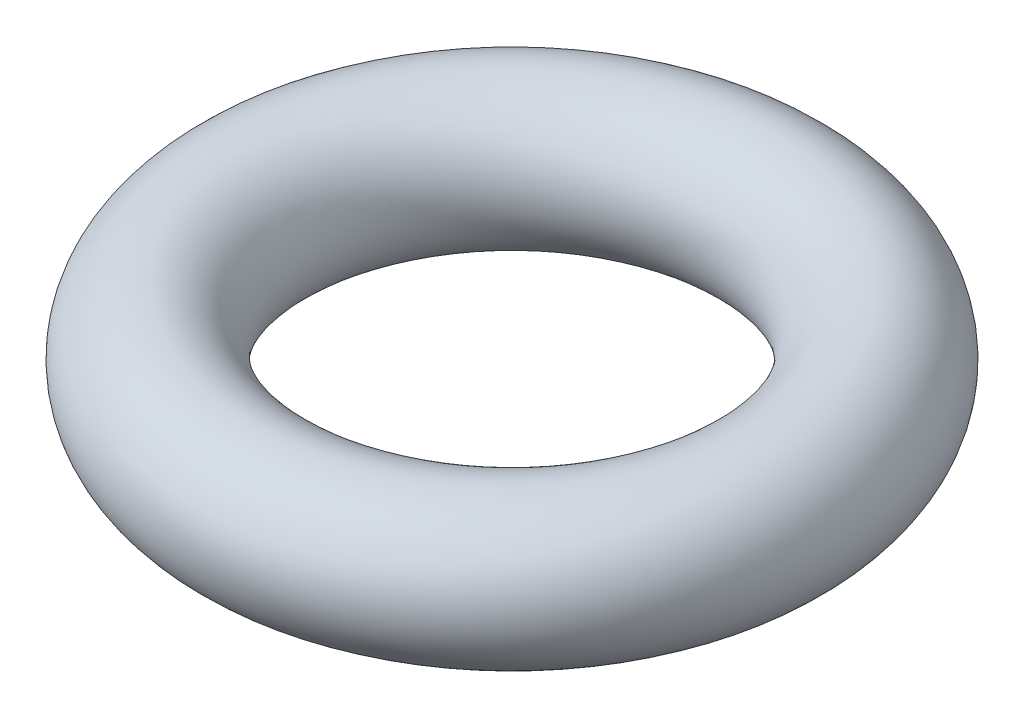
from build123d import *

# Parameters (mm, degrees)
ESQUISSE1_R = 0.95


with BuildPart() as part:
    # Esquisse1 → R_volution1 (revolve)
    with BuildSketch(Plane.XY, mode=Mode.PRIVATE) as r_volution1_sk:
        with Locations((3.4, 0.95)):
            Circle(ESQUISSE1_R)
    revolve(r_volution1_sk.sketch.rotate(Axis((0, 0, 0), (0, 1, 0)), 90), axis=Axis((0, 0, 0), (0, 1, 0)))


solid = part.part
